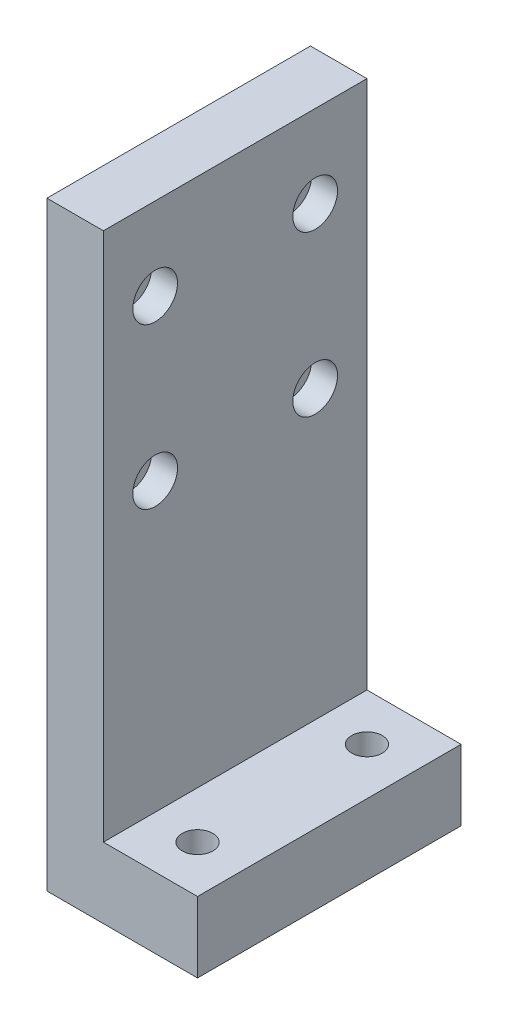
from build123d import *

# Parameters (mm, degrees)
EXTRUDE_1_DEPTH     = 56
SKETCH_2_R          = 2.75
CUT_EXTRUDE_1_DEPTH = 56
SKETCH_3_R          = 4.75
CUT_EXTRUDE_2_DEPTH = 5.5
SKETCH_4_R          = 3.25
CUT_EXTRUDE_3_DEPTH = 143.885443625


with BuildPart() as part:
    # Sketch 1 → Extrude 1 (new body)
    with BuildSketch(Plane.XY):
        Polygon((0, 0), (0, 127.5), (12, 127.5), (12, 15), (32, 15), (32, 0), align=None)
    extrude(amount=EXTRUDE_1_DEPTH)

    # Sketch 2 → Cut-Extrude 1 (cut)
    with BuildSketch(Plane(origin=(12, 0, 0), x_dir=(0, 0, -1), z_dir=(1, 0, 0))):
        with Locations((-45, 110)):
            Circle(SKETCH_2_R)
        with Locations((-11, 110)):
            Circle(SKETCH_2_R)
        with Locations((-11, 76)):
            Circle(SKETCH_2_R)
        with Locations((-45, 76)):
            Circle(SKETCH_2_R)
    extrude(amount=-CUT_EXTRUDE_1_DEPTH, mode=Mode.SUBTRACT)

    # Sketch 3 → Cut-Extrude 2 (cut)
    with BuildSketch(Plane(origin=(12, 0, 0), x_dir=(0, 0, -1), z_dir=(1, 0, 0))):
        with Locations((-45, 110)):
            Circle(SKETCH_3_R)
        with Locations((-11, 110)):
            Circle(SKETCH_3_R)
        with Locations((-11, 76)):
            Circle(SKETCH_3_R)
        with Locations((-45, 76)):
            Circle(SKETCH_3_R)
    extrude(amount=-CUT_EXTRUDE_2_DEPTH, mode=Mode.SUBTRACT)

    # Sketch 4 → Cut-Extrude 3 (cut, through all)
    with BuildSketch(Plane(origin=(0, 127.5, 0), x_dir=(1, 0, 0), z_dir=(0, 1, 0))):
        with Locations(Location((22, -10, 0), (0, 0, 270))):
            Circle(SKETCH_4_R)
        with Locations(Location((22, -46, 0), (0, 0, 270))):
            Circle(SKETCH_4_R)
    extrude(amount=-CUT_EXTRUDE_3_DEPTH, mode=Mode.SUBTRACT)


solid = part.part
